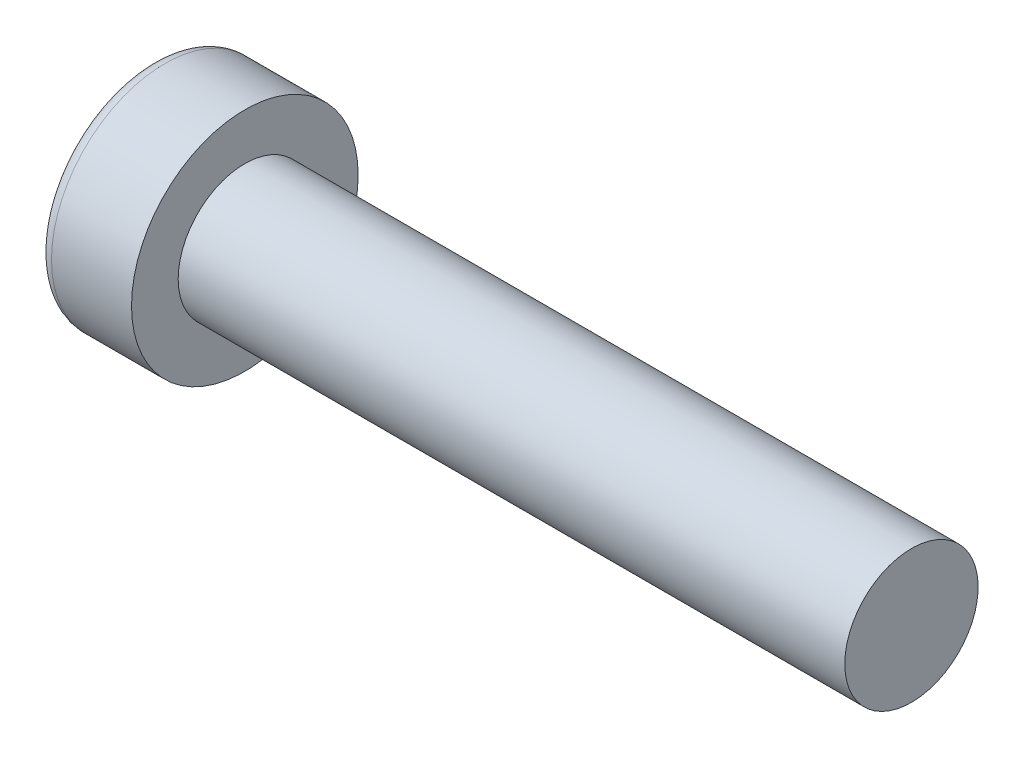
from build123d import *

# Parameters (mm, degrees)
VERRUNDUNG1_R                   = 0.5
SCHNITT_LINEAR_AUSTRAGEN1_DEPTH = 3


with BuildPart() as part:
    # Skizze1 → Rotation1 (revolve)
    with BuildSketch(Plane.XY, mode=Mode.PRIVATE) as rotation1_sk:
        Polygon((-28.5, 0), (-28.5, 4.25), (-25, 4.25), (-25, 2.5), (0, 2.5), (0, 0), align=None)
    revolve(rotation1_sk.sketch.rotate(Axis((-65.011808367, 0, 0), (1, 0, 0)), 90), axis=Axis((-65.011808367, 0, 0), (1, 0, 0)))

    # Verrundung1
    verrundung1_edges = [part.edges().sort_by_distance(p)[0] for p in [
        (-28.5, 0, -4.25),
    ]]
    fillet(verrundung1_edges, radius=VERRUNDUNG1_R)

    # Skizze2 → Schnitt-Linear austragen1 (cut)
    with BuildSketch(Plane.ZY.offset(28.5)):
        Polygon((2, 1.154700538), (0, 2.309401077), (-2, 1.154700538), (-2, -1.154700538), (0, -2.309401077), (2, -1.154700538), align=None)
    extrude(amount=-SCHNITT_LINEAR_AUSTRAGEN1_DEPTH, mode=Mode.SUBTRACT)


solid = part.part
